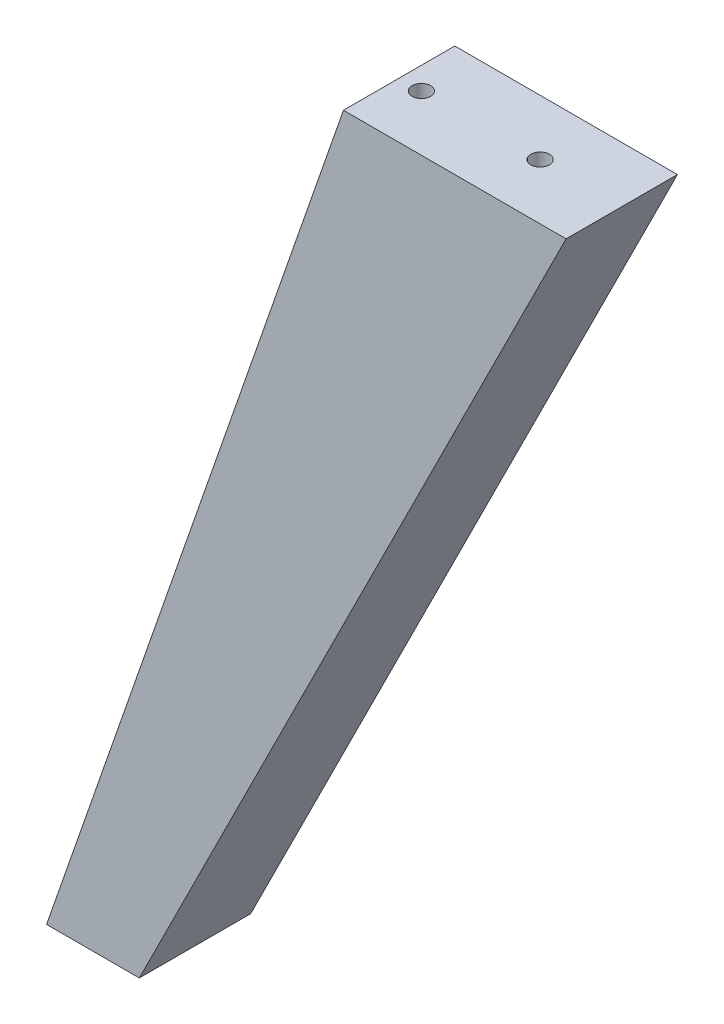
from build123d import *

# Parameters (mm, degrees)
BOSS_EXTRU_1_DEPTH      = 15
ESQUISSE2_R             = 2.5
ENL_V_MAT_EXTRU_1_DEPTH = 25


with BuildPart() as part:
    # Esquisse1 → Boss.-Extru.1 (new, symmetric)
    with BuildSketch(Plane.XY):
        Polygon((25, 0), (0, 0), (80, 230), (140, 230), align=None)
    extrude(amount=BOSS_EXTRU_1_DEPTH, both=True)

    # Esquisse2 → Enl_v. mat.-Extru.1 (cut)
    with BuildSketch(Plane(origin=(0, 230, 0), x_dir=(1, 0, 0), z_dir=(0, 1, 0))):
        with Locations(Location((118, 0, 0), (0, 0, 270))):
            Circle(ESQUISSE2_R)
        with Locations(Location((86, 0, 0), (0, 0, 270))):
            Circle(ESQUISSE2_R)
    extrude(amount=-ENL_V_MAT_EXTRU_1_DEPTH, mode=Mode.SUBTRACT)


solid = part.part
